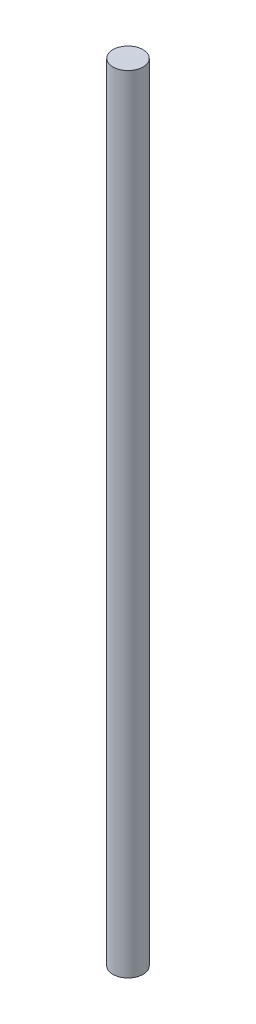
ISO-10303-21;
HEADER;
FILE_DESCRIPTION(('STEP AP214'),'2;1');
FILE_NAME('part.step','',(''),(''),'','','');
FILE_SCHEMA(('AUTOMOTIVE_DESIGN { 1 0 10303 214 1 1 1 1 }'));
ENDSEC;
DATA;
#1=APPLICATION_CONTEXT('core data for automotive mechanical design processes');
#2=APPLICATION_PROTOCOL_DEFINITION('international standard','automotive_design',2000,#1);
#3=PRODUCT_CONTEXT('',#1,'mechanical');
#4=PRODUCT('Part','Part','',(#3));
#5=PRODUCT_RELATED_PRODUCT_CATEGORY('part','',(#4));
#6=PRODUCT_DEFINITION_FORMATION('','',#4);
#7=PRODUCT_DEFINITION_CONTEXT('part definition',#1,'design');
#8=PRODUCT_DEFINITION('design','',#6,#7);
#9=PRODUCT_DEFINITION_SHAPE('','',#8);
#10=(LENGTH_UNIT() NAMED_UNIT(*) SI_UNIT(.MILLI.,.METRE.));
#11=(NAMED_UNIT(*) PLANE_ANGLE_UNIT() SI_UNIT($,.RADIAN.));
#12=(NAMED_UNIT(*) SI_UNIT($,.STERADIAN.) SOLID_ANGLE_UNIT());
#13=UNCERTAINTY_MEASURE_WITH_UNIT(LENGTH_MEASURE(1.E-05),#10,'distance_accuracy_value','');
#14=(GEOMETRIC_REPRESENTATION_CONTEXT(3) GLOBAL_UNCERTAINTY_ASSIGNED_CONTEXT((#13)) GLOBAL_UNIT_ASSIGNED_CONTEXT((#10,
#11,#12)) REPRESENTATION_CONTEXT('',''));
#15=CARTESIAN_POINT('',(0.,0.,0.));
#16=DIRECTION('',(0.,0.,1.));
#17=DIRECTION('',(1.,0.,0.));
#18=AXIS2_PLACEMENT_3D('',#15,#16,#17);
#19=CARTESIAN_POINT('',(0.,52.25,0.));
#20=DIRECTION('',(0.,-1.,0.));
#21=DIRECTION('',(0.,0.,-1.));
#22=AXIS2_PLACEMENT_3D('',#19,#20,#21);
#23=CYLINDRICAL_SURFACE('',#22,2.);
#24=CARTESIAN_POINT('',(0.,52.25,0.));
#25=DIRECTION('',(0.,1.,0.));
#26=DIRECTION('',(0.,0.,1.));
#27=AXIS2_PLACEMENT_3D('',#24,#25,#26);
#28=CIRCLE('',#27,2.);
#29=CARTESIAN_POINT('',(0.,52.25,2.));
#30=VERTEX_POINT('',#29);
#31=EDGE_CURVE('E10',#30,#30,#28,.T.);
#32=ORIENTED_EDGE('',*,*,#31,.F.);
#33=EDGE_LOOP('',(#32));
#34=FACE_BOUND('',#33,.T.);
#35=CARTESIAN_POINT('',(0.,-52.25,0.));
#36=DIRECTION('',(0.,1.,0.));
#37=DIRECTION('',(0.,0.,1.));
#38=AXIS2_PLACEMENT_3D('',#35,#36,#37);
#39=CIRCLE('',#38,2.);
#40=CARTESIAN_POINT('',(0.,-52.25,2.));
#41=VERTEX_POINT('',#40);
#42=EDGE_CURVE('E40',#41,#41,#39,.T.);
#43=ORIENTED_EDGE('',*,*,#42,.T.);
#44=EDGE_LOOP('',(#43));
#45=FACE_BOUND('',#44,.T.);
#46=ADVANCED_FACE('F37',(#34,#45),#23,.T.);
#47=CARTESIAN_POINT('',(0.,52.25,0.));
#48=DIRECTION('',(0.,1.,0.));
#49=DIRECTION('',(0.,0.,1.));
#50=AXIS2_PLACEMENT_3D('',#47,#48,#49);
#51=PLANE('',#50);
#52=ORIENTED_EDGE('',*,*,#31,.T.);
#53=EDGE_LOOP('',(#52));
#54=FACE_BOUND('',#53,.T.);
#55=ADVANCED_FACE('F52',(#54),#51,.T.);
#56=CARTESIAN_POINT('',(0.,-52.25,0.));
#57=DIRECTION('',(0.,1.,0.));
#58=DIRECTION('',(0.,0.,1.));
#59=AXIS2_PLACEMENT_3D('',#56,#57,#58);
#60=PLANE('',#59);
#61=ORIENTED_EDGE('',*,*,#42,.F.);
#62=EDGE_LOOP('',(#61));
#63=FACE_BOUND('',#62,.T.);
#64=ADVANCED_FACE('F50',(#63),#60,.F.);
#65=CLOSED_SHELL('',(#46,#55,#64));
#66=MANIFOLD_SOLID_BREP('B2',#65);
#67=ADVANCED_BREP_SHAPE_REPRESENTATION('',(#18,#66),#14);
#68=SHAPE_DEFINITION_REPRESENTATION(#9,#67);
ENDSEC;
END-ISO-10303-21;
